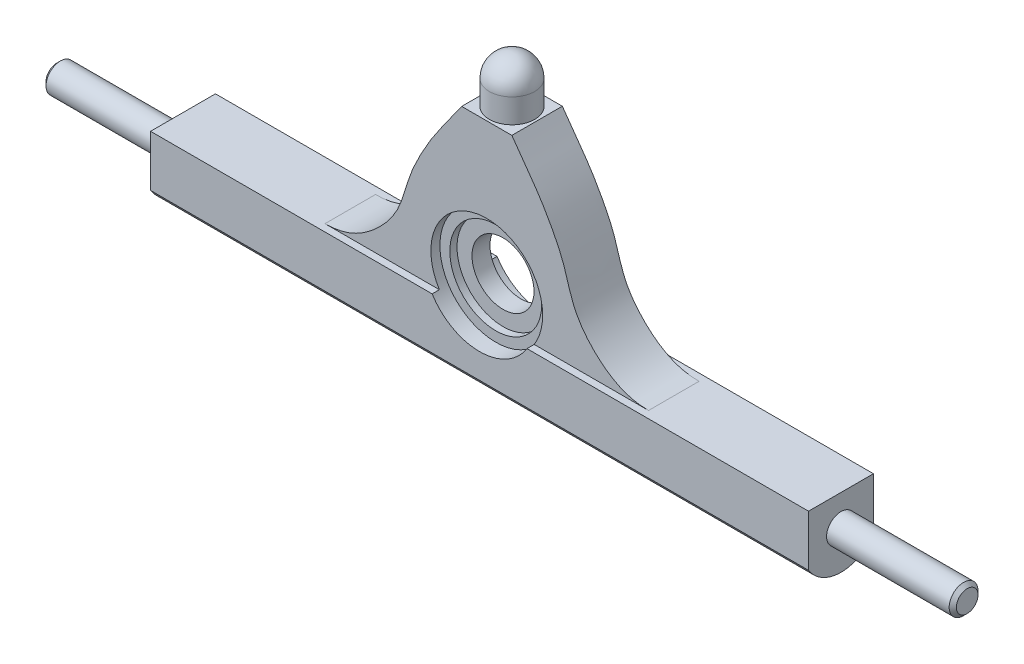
from build123d import *

# Parameters (mm, degrees)
ESQUISSE1_W             = 252.5
ESQUISSE1_H             = 4
BOSS_EXTRU_1_DEPTH      = 91.25
BOSS_EXTRU_2_DEPTH      = 7
ESQUISSE7_R             = 8.6
ENL_V_MAT_EXTRU_1_DEPTH = 140.170306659
ESQUISSE8_R             = 15.5
ENL_V_MAT_EXTRU_2_DEPTH = 4.5
ESQUISSE9_R             = 12.75
ENL_V_MAT_EXTRU_3_DEPTH = 2
CHANFREIN1_SIZE         = 1


with BuildPart() as part:
    # Esquisse1 → R_volution1 (revolve)
    with BuildSketch(Plane.XY, mode=Mode.PRIVATE) as r_volution1_sk:
        with Locations((0, 2)):
            Rectangle(ESQUISSE1_W, ESQUISSE1_H)
    revolve(r_volution1_sk.sketch.rotate(Axis((126.25, 0, 0), (-1, 0, 0)), 90), axis=Axis((126.25, 0, 0), (-1, 0, 0)))

    # Esquisse3 → Boss.-Extru.1 (add, symmetric)
    with BuildSketch(Plane(origin=(0, 0, 0), x_dir=(0, 0, -1), z_dir=(1, 0, 0))):
        with BuildLine():
            Line((9, 8.6), (-9, 8.6))
            Line((-9, 8.6), (-9, -5.6))
            ThreePointArc((-9, -5.6), (0, -10.6), (9, -5.6))
            Line((9, -5.6), (9, 8.6))
        make_face()
    extrude(amount=BOSS_EXTRU_1_DEPTH, both=True)

    # Esquisse5 → Boss.-Extru.2 (add, symmetric)
    with BuildSketch(Plane.XY):
        with BuildLine():
            Line((-6.959099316, 55.725324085), (6.959099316, 55.725324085))
            add(Edge.make_bspline(
                [(44.871833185, 8.6), (42.369002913, 8.6), (36.956855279, 9.575098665), (29.694631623, 14.788218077), (23.579730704, 22.742606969), (22.003873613, 30.83189236), (18.660047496, 38.064755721), (14.251804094, 45.942320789), (9.561039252, 51.918413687), (6.959099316, 55.725324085)],
                knots=[0, 0, 0, 0, 0.111428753, 0.262063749, 0.40667367, 0.575180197, 0.642676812, 0.782298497, 1, 1, 1, 1], degree=3))
            Line((44.871833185, 8.6), (-44.871833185, 8.6))
            add(Edge.make_bspline(
                [(-44.871833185, 8.6), (-42.369002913, 8.6), (-36.956855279, 9.575098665), (-29.694631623, 14.788218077), (-23.579730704, 22.742606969), (-22.003873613, 30.83189236), (-18.660047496, 38.064755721), (-14.251804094, 45.942320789), (-9.561039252, 51.918413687), (-6.959099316, 55.725324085)],
                knots=[0, 0, 0, 0, 0.111428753, 0.262063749, 0.40667367, 0.575180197, 0.642676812, 0.782298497, 1, 1, 1, 1], degree=3))
        make_face()
    extrude(amount=BOSS_EXTRU_2_DEPTH, both=True)

    # Esquisse7 → Enl_v. mat.-Extru.1 (cut, through all)
    with BuildSketch(Plane.XY.offset(9)):
        with Locations(Location((0, 16.8, 0), (0, 0, 287.543500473))):
            Circle(ESQUISSE7_R)
    extrude(amount=-ENL_V_MAT_EXTRU_1_DEPTH, mode=Mode.SUBTRACT)

    # Esquisse8 → Enl_v. mat.-Extru.2 (cut)
    with BuildSketch(Plane.XY.offset(9)):
        with Locations((0, 16.8)):
            Circle(ESQUISSE8_R)
    enl_v_mat_extru_2 = extrude(amount=-ENL_V_MAT_EXTRU_2_DEPTH, mode=Mode.SUBTRACT)

    # Esquisse9 → Enl_v. mat.-Extru.3 (cut)
    with BuildSketch(Plane.XY.offset(4.5)):
        with Locations((0, 16.8)):
            Circle(ESQUISSE9_R)
    enl_v_mat_extru_3 = extrude(amount=-ENL_V_MAT_EXTRU_3_DEPTH, mode=Mode.SUBTRACT)

    # Sym_trie1: Enl_v. mat.-Extru.2, Enl_v. mat.-Extru.3 across plane
    add(enl_v_mat_extru_2.mirror(Plane.XY), mode=Mode.SUBTRACT)
    add(enl_v_mat_extru_3.mirror(Plane.XY), mode=Mode.SUBTRACT)

    # Esquisse10 → R_volution2 (revolve)
    with BuildSketch(Plane.XY):
        with BuildLine():
            Line((0, 55.725324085), (-6.3, 55.725324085))
            Line((-6.3, 55.725324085), (-6.3, 62.425324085))
            ThreePointArc((-6.3, 62.425324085), (-4.454772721, 66.880096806), (0, 68.725324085))
            Line((0, 68.725324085), (0, 55.725324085))
        make_face()
    revolve(axis=Axis((0, 68.725324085, 0), (0, -1, 0)))

    # Chanfrein1
    chanfrein1_edges = [part.edges().sort_by_distance(p)[0] for p in [
        (-126.25, 0, 4),
        (126.25, 0, 4),
    ]]
    chamfer(chanfrein1_edges, length=CHANFREIN1_SIZE)


solid = part.part
